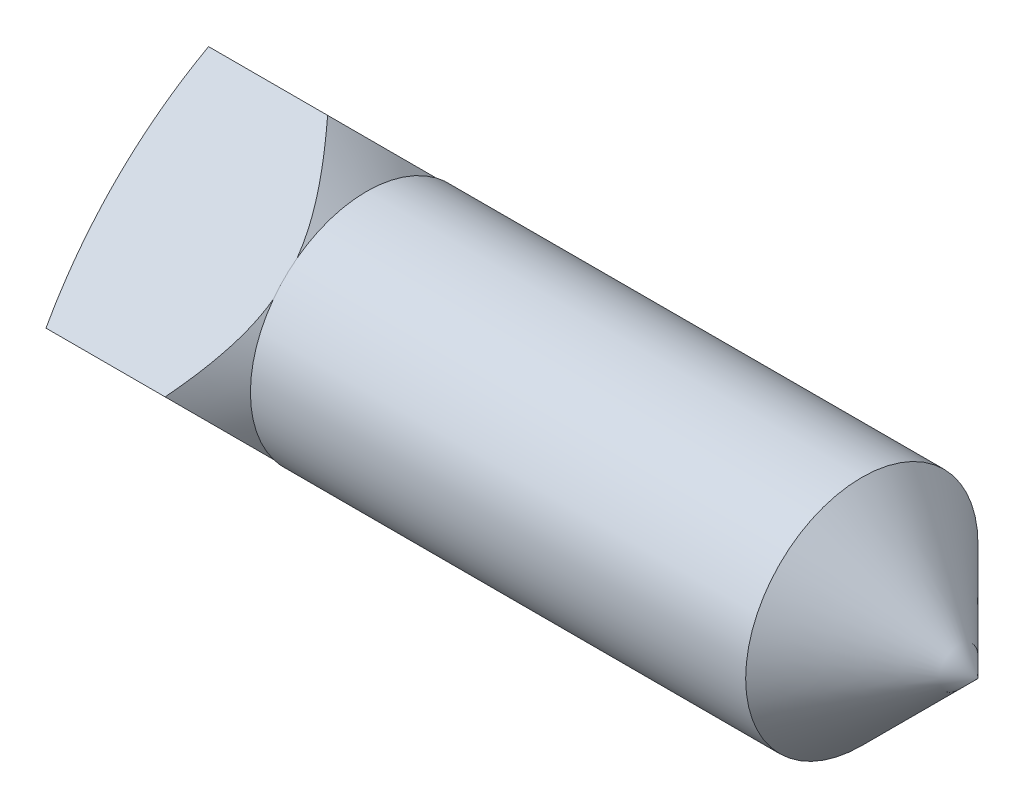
ISO-10303-21;
HEADER;
FILE_DESCRIPTION(('STEP AP214'),'2;1');
FILE_NAME('part.step','',(''),(''),'','','');
FILE_SCHEMA(('AUTOMOTIVE_DESIGN { 1 0 10303 214 1 1 1 1 }'));
ENDSEC;
DATA;
#1=APPLICATION_CONTEXT('core data for automotive mechanical design processes');
#2=APPLICATION_PROTOCOL_DEFINITION('international standard','automotive_design',2000,#1);
#3=PRODUCT_CONTEXT('',#1,'mechanical');
#4=PRODUCT('Part','Part','',(#3));
#5=PRODUCT_RELATED_PRODUCT_CATEGORY('part','',(#4));
#6=PRODUCT_DEFINITION_FORMATION('','',#4);
#7=PRODUCT_DEFINITION_CONTEXT('part definition',#1,'design');
#8=PRODUCT_DEFINITION('design','',#6,#7);
#9=PRODUCT_DEFINITION_SHAPE('','',#8);
#10=(LENGTH_UNIT() NAMED_UNIT(*) SI_UNIT(.MILLI.,.METRE.));
#11=(NAMED_UNIT(*) PLANE_ANGLE_UNIT() SI_UNIT($,.RADIAN.));
#12=(NAMED_UNIT(*) SI_UNIT($,.STERADIAN.) SOLID_ANGLE_UNIT());
#13=UNCERTAINTY_MEASURE_WITH_UNIT(LENGTH_MEASURE(1.E-05),#10,'distance_accuracy_value','');
#14=(GEOMETRIC_REPRESENTATION_CONTEXT(3) GLOBAL_UNCERTAINTY_ASSIGNED_CONTEXT((#13)) GLOBAL_UNIT_ASSIGNED_CONTEXT((#10,
#11,#12)) REPRESENTATION_CONTEXT('',''));
#15=CARTESIAN_POINT('',(0.,0.,0.));
#16=DIRECTION('',(0.,0.,1.));
#17=DIRECTION('',(1.,0.,0.));
#18=AXIS2_PLACEMENT_3D('',#15,#16,#17);
#19=CARTESIAN_POINT('',(-3.7592,0.,-3.376576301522));
#20=DIRECTION('',(0.,-0.707106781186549,0.707106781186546));
#21=DIRECTION('',(0.,-0.707106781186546,-0.707106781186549));
#22=AXIS2_PLACEMENT_3D('',#19,#20,#21);
#23=PLANE('',#22);
#24=CARTESIAN_POINT('',(-3.71463670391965,-2.84404188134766,-6.22061818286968));
#25=CARTESIAN_POINT('',(-3.55613835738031,-2.70146848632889,-6.07804478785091));
#26=CARTESIAN_POINT('',(-3.3981461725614,-2.55860959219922,-5.93518589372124));
#27=CARTESIAN_POINT('',(-3.08363247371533,-2.27203984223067,-5.64861614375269));
#28=CARTESIAN_POINT('',(-2.92711125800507,-2.12832882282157,-5.50490512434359));
#29=CARTESIAN_POINT('',(-2.61537743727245,-1.83919610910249,-5.2157724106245));
#30=CARTESIAN_POINT('',(-2.46017361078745,-1.69376967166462,-5.07034597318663));
#31=CARTESIAN_POINT('',(-2.15261018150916,-1.40143979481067,-4.77801609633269));
#32=CARTESIAN_POINT('',(-2.00025026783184,-1.25453651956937,-4.63111282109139));
#33=CARTESIAN_POINT('',(-1.72970912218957,-0.988182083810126,-4.36475838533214));
#34=CARTESIAN_POINT('',(-1.6107818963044,-0.869111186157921,-4.24568748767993));
#35=CARTESIAN_POINT('',(-1.37665028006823,-0.629105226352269,-4.00568152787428));
#36=CARTESIAN_POINT('',(-1.2614467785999,-0.508169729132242,-3.88474603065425));
#37=CARTESIAN_POINT('',(-1.03648369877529,-0.263755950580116,-3.64033225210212));
#38=CARTESIAN_POINT('',(-0.926724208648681,-0.140277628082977,-3.51685392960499));
#39=CARTESIAN_POINT('',(-0.768411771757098,0.0475823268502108,-3.3289939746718));
#40=CARTESIAN_POINT('',(-0.716703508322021,0.110632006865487,-3.26594429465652));
#41=CARTESIAN_POINT('',(-0.615958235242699,0.237786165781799,-3.13879013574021));
#42=CARTESIAN_POINT('',(-0.566920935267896,0.301890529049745,-3.07468577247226));
#43=CARTESIAN_POINT('',(-0.470564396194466,0.433616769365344,-2.94295953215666));
#44=CARTESIAN_POINT('',(-0.423365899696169,0.501283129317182,-2.87529317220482));
#45=CARTESIAN_POINT('',(-0.33366468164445,0.638144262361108,-2.7384320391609));
#46=CARTESIAN_POINT('',(-0.29116048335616,0.707338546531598,-2.66923775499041));
#47=CARTESIAN_POINT('',(-0.21229503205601,0.847303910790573,-2.52927239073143));
#48=CARTESIAN_POINT('',(-0.175920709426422,0.918071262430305,-2.4585050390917));
#49=CARTESIAN_POINT('',(-0.110910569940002,1.06137320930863,-2.31520309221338));
#50=CARTESIAN_POINT('',(-0.0822720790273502,1.13390718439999,-2.24266911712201));
#51=CARTESIAN_POINT('',(-0.0393755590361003,1.26582470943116,-2.11075159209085));
#52=CARTESIAN_POINT('',(-0.0233846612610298,1.3249242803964,-2.05165202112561));
#53=CARTESIAN_POINT('',(0.00161538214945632,1.44386018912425,-1.93271611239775));
#54=CARTESIAN_POINT('',(0.0106258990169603,1.50369637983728,-1.87287992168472));
#55=CARTESIAN_POINT('',(0.021092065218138,1.62355655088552,-1.75301975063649));
#56=CARTESIAN_POINT('',(0.0225662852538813,1.68357970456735,-1.69299659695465));
#57=CARTESIAN_POINT('',(0.0179155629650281,1.80348109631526,-1.57309520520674));
#58=CARTESIAN_POINT('',(0.0117896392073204,1.8633593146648,-1.5132169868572));
#59=CARTESIAN_POINT('',(-0.0100815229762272,1.99721927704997,-1.37935702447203));
#60=CARTESIAN_POINT('',(-0.02782647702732,2.0710373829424,-1.3055389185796));
#61=CARTESIAN_POINT('',(-0.0730208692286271,2.21718932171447,-1.15938697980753));
#62=CARTESIAN_POINT('',(-0.100477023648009,2.28952209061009,-1.08705421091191));
#63=CARTESIAN_POINT('',(-0.147658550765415,2.39694211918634,-0.979634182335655));
#64=CARTESIAN_POINT('',(-0.164455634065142,2.43269379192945,-0.943882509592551));
#65=CARTESIAN_POINT('',(-0.199813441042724,2.50374093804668,-0.872835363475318));
#66=CARTESIAN_POINT('',(-0.218373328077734,2.5390366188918,-0.837539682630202));
#67=CARTESIAN_POINT('',(-0.257053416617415,2.60919264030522,-0.767383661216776));
#68=CARTESIAN_POINT('',(-0.277173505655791,2.64405301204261,-0.732523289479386));
#69=CARTESIAN_POINT('',(-0.318791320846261,2.71336326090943,-0.663213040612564));
#70=CARTESIAN_POINT('',(-0.340289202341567,2.74781309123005,-0.628763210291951));
#71=CARTESIAN_POINT('',(-0.40321540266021,2.84534321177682,-0.531233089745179));
#72=CARTESIAN_POINT('',(-0.446099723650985,2.90795472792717,-0.468621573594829));
#73=CARTESIAN_POINT('',(-0.535121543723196,3.03201522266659,-0.344561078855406));
#74=CARTESIAN_POINT('',(-0.58125974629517,3.09346394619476,-0.28311235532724));
#75=CARTESIAN_POINT('',(-0.723571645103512,3.27639274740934,-0.100183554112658));
#76=CARTESIAN_POINT('',(-0.82358874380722,3.39637526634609,0.019798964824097));
#77=CARTESIAN_POINT('',(-1.03047356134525,3.63375592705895,0.257179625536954));
#78=CARTESIAN_POINT('',(-1.13735948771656,3.75114599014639,0.374569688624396));
#79=CARTESIAN_POINT('',(-1.35557896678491,3.98376603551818,0.607189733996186));
#80=CARTESIAN_POINT('',(-1.46691077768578,4.09899683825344,0.722420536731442));
#81=CARTESIAN_POINT('',(-1.69305612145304,4.32823502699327,0.951658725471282));
#82=CARTESIAN_POINT('',(-1.80787896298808,4.44223779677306,1.06566149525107));
#83=CARTESIAN_POINT('',(-2.03983717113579,4.66907271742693,1.29249641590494));
#84=CARTESIAN_POINT('',(-2.15697273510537,4.78190476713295,1.40532846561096));
#85=CARTESIAN_POINT('',(-2.39279712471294,5.00650286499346,1.62992656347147));
#86=CARTESIAN_POINT('',(-2.51148349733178,5.11827020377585,1.74169390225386));
#87=CARTESIAN_POINT('',(-2.75017246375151,5.34109999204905,1.96452369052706));
#88=CARTESIAN_POINT('',(-2.87017506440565,5.4521624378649,2.07558613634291));
#89=CARTESIAN_POINT('',(-3.05068333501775,5.61808795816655,2.24151165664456));
#90=CARTESIAN_POINT('',(-3.11080136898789,5.67316227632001,2.29658597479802));
#91=CARTESIAN_POINT('',(-3.23127854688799,5.78319708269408,2.40662078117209));
#92=CARTESIAN_POINT('',(-3.2916377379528,5.83815754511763,2.46158124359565));
#93=CARTESIAN_POINT('',(-3.41233885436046,5.94776482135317,2.57118851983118));
#94=CARTESIAN_POINT('',(-3.47268003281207,6.00241204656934,2.62583574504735));
#95=CARTESIAN_POINT('',(-3.59353260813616,6.11159399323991,2.73501769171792));
#96=CARTESIAN_POINT('',(-3.65404396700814,6.1661287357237,2.78955243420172));
#97=CARTESIAN_POINT('',(-3.71463670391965,6.22061818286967,2.84404188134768));
#98=B_SPLINE_CURVE_WITH_KNOTS('',3,(#24,#25,#26,#27,#28,#29,#30,#31,#32,#33,#34,#35,#36,#37,#38,
#39,#40,#41,#42,#43,#44,#45,#46,#47,#48,#49,#50,#51,#52,#53,#54,#55,#56,#57,#58,#59,#60,#61,#62,
#63,#64,#65,#66,#67,#68,#69,#70,#71,#72,#73,#74,#75,#76,#77,#78,#79,#80,#81,#82,#83,#84,#85,#86,
#87,#88,#89,#90,#91,#92,#93,#94,#95,#96,#97),.UNSPECIFIED.,.F.,.F.,(4,2,2,2,2,2,2,2,2,2,2,2,2,2,
2,2,2,2,2,2,2,2,2,2,2,2,2,2,2,2,2,2,2,2,2,2,4),(0.,0.769411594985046,1.53897600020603,
2.31192373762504,3.08478647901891,3.70321119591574,4.32178246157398,4.94036374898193,
5.24955145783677,5.55870549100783,5.87871228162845,6.19861811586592,6.51783299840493,
6.8369373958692,7.09196626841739,7.3469450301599,7.60129517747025,7.85567817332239,
8.17279662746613,8.49013483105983,8.6499415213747,8.80967274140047,8.96939245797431,
9.12913021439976,9.42418817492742,9.7193101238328,10.3099299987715,10.9021857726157,
11.4942117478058,12.0879855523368,12.6818102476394,13.2747881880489,13.8677692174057,
14.1629380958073,14.4581678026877,14.7523159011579,15.0464028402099),.UNSPECIFIED.);
#99=CARTESIAN_POINT('',(-0.808536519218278,0.,-3.376576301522));
#100=VERTEX_POINT('',#99);
#101=CARTESIAN_POINT('',(0.,1.44137193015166,-1.93520437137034));
#102=VERTEX_POINT('',#101);
#103=EDGE_CURVE('E157',#100,#102,#98,.T.);
#104=ORIENTED_EDGE('',*,*,#103,.F.);
#105=DIRECTION('',(1.,0.,0.));
#106=VECTOR('',#105,1.);
#107=CARTESIAN_POINT('',(-3.7592,0.,-3.376576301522));
#108=LINE('',#107,#106);
#109=CARTESIAN_POINT('',(-3.2823012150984,0.,-3.376576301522));
#110=VERTEX_POINT('',#109);
#111=EDGE_CURVE('E138',#110,#100,#108,.T.);
#112=ORIENTED_EDGE('',*,*,#111,.F.);
#113=CARTESIAN_POINT('',(8.4328,1.688288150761,-1.688288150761));
#114=DIRECTION('',(0.,-0.707106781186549,0.707106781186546));
#115=DIRECTION('',(0.,-0.707106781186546,-0.707106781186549));
#116=AXIS2_PLACEMENT_3D('',#113,#114,#115);
#117=CIRCLE('',#116,11.9559286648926);
#118=CARTESIAN_POINT('',(-3.2823012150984,3.376576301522,0.));
#119=VERTEX_POINT('',#118);
#120=EDGE_CURVE('E147',#119,#110,#117,.T.);
#121=ORIENTED_EDGE('',*,*,#120,.F.);
#122=DIRECTION('',(1.,0.,0.));
#123=VECTOR('',#122,1.);
#124=CARTESIAN_POINT('',(-3.7592,3.376576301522,0.));
#125=LINE('',#124,#123);
#126=CARTESIAN_POINT('',(-0.808536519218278,3.376576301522,0.));
#127=VERTEX_POINT('',#126);
#128=EDGE_CURVE('E145',#119,#127,#125,.T.);
#129=ORIENTED_EDGE('',*,*,#128,.T.);
#130=CARTESIAN_POINT('',(0.,1.93520437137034,-1.44137193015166));
#131=VERTEX_POINT('',#130);
#132=EDGE_CURVE('E167',#131,#127,#98,.T.);
#133=ORIENTED_EDGE('',*,*,#132,.F.);
#134=DIRECTION('',(0.,-0.707106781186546,-0.707106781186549));
#135=VECTOR('',#134,1.);
#136=CARTESIAN_POINT('',(0.,0.,-3.376576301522));
#137=LINE('',#136,#135);
#138=EDGE_CURVE('E41',#131,#102,#137,.T.);
#139=ORIENTED_EDGE('',*,*,#138,.T.);
#140=EDGE_LOOP('',(#104,#112,#121,#129,#133,#139));
#141=FACE_BOUND('',#140,.T.);
#142=ADVANCED_FACE('F33',(#141),#23,.F.);
#143=CARTESIAN_POINT('',(-3.7592,0.,-3.376576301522));
#144=DIRECTION('',(0.,0.707106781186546,0.707106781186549));
#145=DIRECTION('',(0.,-0.707106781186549,0.707106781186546));
#146=AXIS2_PLACEMENT_3D('',#143,#144,#145);
#147=PLANE('',#146);
#148=CARTESIAN_POINT('',(-3.71463670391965,-6.22061818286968,2.84404188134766));
#149=CARTESIAN_POINT('',(-3.55613835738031,-6.07804478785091,2.70146848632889));
#150=CARTESIAN_POINT('',(-3.3981461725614,-5.93518589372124,2.55860959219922));
#151=CARTESIAN_POINT('',(-3.08363247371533,-5.64861614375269,2.27203984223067));
#152=CARTESIAN_POINT('',(-2.92711125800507,-5.50490512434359,2.12832882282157));
#153=CARTESIAN_POINT('',(-2.61537743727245,-5.2157724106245,1.83919610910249));
#154=CARTESIAN_POINT('',(-2.46017361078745,-5.07034597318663,1.69376967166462));
#155=CARTESIAN_POINT('',(-2.15261018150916,-4.77801609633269,1.40143979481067));
#156=CARTESIAN_POINT('',(-2.00025026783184,-4.63111282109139,1.25453651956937));
#157=CARTESIAN_POINT('',(-1.72970912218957,-4.36475838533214,0.988182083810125));
#158=CARTESIAN_POINT('',(-1.6107818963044,-4.24568748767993,0.86911118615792));
#159=CARTESIAN_POINT('',(-1.37665028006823,-4.00568152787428,0.629105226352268));
#160=CARTESIAN_POINT('',(-1.2614467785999,-3.88474603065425,0.508169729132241));
#161=CARTESIAN_POINT('',(-1.03648369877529,-3.64033225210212,0.263755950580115));
#162=CARTESIAN_POINT('',(-0.92672420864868,-3.51685392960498,0.140277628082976));
#163=CARTESIAN_POINT('',(-0.768411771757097,-3.3289939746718,-0.0475823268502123));
#164=CARTESIAN_POINT('',(-0.716703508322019,-3.26594429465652,-0.110632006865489));
#165=CARTESIAN_POINT('',(-0.615958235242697,-3.13879013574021,-0.237786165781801));
#166=CARTESIAN_POINT('',(-0.566920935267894,-3.07468577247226,-0.301890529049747));
#167=CARTESIAN_POINT('',(-0.470564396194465,-2.94295953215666,-0.433616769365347));
#168=CARTESIAN_POINT('',(-0.423365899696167,-2.87529317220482,-0.501283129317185));
#169=CARTESIAN_POINT('',(-0.333664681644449,-2.7384320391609,-0.63814426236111));
#170=CARTESIAN_POINT('',(-0.291160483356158,-2.6692377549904,-0.707338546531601));
#171=CARTESIAN_POINT('',(-0.212295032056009,-2.52927239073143,-0.847303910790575));
#172=CARTESIAN_POINT('',(-0.175920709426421,-2.4585050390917,-0.918071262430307));
#173=CARTESIAN_POINT('',(-0.110910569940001,-2.31520309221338,-1.06137320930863));
#174=CARTESIAN_POINT('',(-0.08227207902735,-2.24266911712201,-1.13390718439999));
#175=CARTESIAN_POINT('',(-0.0393755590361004,-2.11075159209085,-1.26582470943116));
#176=CARTESIAN_POINT('',(-0.0233846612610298,-2.0516520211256,-1.3249242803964));
#177=CARTESIAN_POINT('',(0.00161538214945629,-1.93271611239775,-1.44386018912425));
#178=CARTESIAN_POINT('',(0.0106258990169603,-1.87287992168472,-1.50369637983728));
#179=CARTESIAN_POINT('',(0.0210920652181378,-1.75301975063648,-1.62355655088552));
#180=CARTESIAN_POINT('',(0.0225662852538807,-1.69299659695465,-1.68357970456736));
#181=CARTESIAN_POINT('',(0.0179155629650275,-1.57309520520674,-1.80348109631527));
#182=CARTESIAN_POINT('',(0.01178963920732,-1.5132169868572,-1.8633593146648));
#183=CARTESIAN_POINT('',(-0.0100815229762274,-1.37935702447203,-1.99721927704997));
#184=CARTESIAN_POINT('',(-0.0278264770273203,-1.3055389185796,-2.0710373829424));
#185=CARTESIAN_POINT('',(-0.0730208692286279,-1.15938697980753,-2.21718932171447));
#186=CARTESIAN_POINT('',(-0.10047702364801,-1.08705421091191,-2.28952209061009));
#187=CARTESIAN_POINT('',(-0.147658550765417,-0.979634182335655,-2.39694211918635));
#188=CARTESIAN_POINT('',(-0.164455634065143,-0.94388250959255,-2.43269379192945));
#189=CARTESIAN_POINT('',(-0.199813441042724,-0.872835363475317,-2.50374093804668));
#190=CARTESIAN_POINT('',(-0.218373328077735,-0.837539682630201,-2.5390366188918));
#191=CARTESIAN_POINT('',(-0.257053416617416,-0.767383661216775,-2.60919264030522));
#192=CARTESIAN_POINT('',(-0.277173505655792,-0.732523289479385,-2.64405301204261));
#193=CARTESIAN_POINT('',(-0.318791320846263,-0.663213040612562,-2.71336326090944));
#194=CARTESIAN_POINT('',(-0.340289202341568,-0.628763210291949,-2.74781309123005));
#195=CARTESIAN_POINT('',(-0.403215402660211,-0.531233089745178,-2.84534321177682));
#196=CARTESIAN_POINT('',(-0.446099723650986,-0.468621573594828,-2.90795472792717));
#197=CARTESIAN_POINT('',(-0.535121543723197,-0.344561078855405,-3.03201522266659));
#198=CARTESIAN_POINT('',(-0.581259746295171,-0.283112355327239,-3.09346394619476));
#199=CARTESIAN_POINT('',(-0.723571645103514,-0.100183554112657,-3.27639274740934));
#200=CARTESIAN_POINT('',(-0.823588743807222,0.0197989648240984,-3.39637526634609));
#201=CARTESIAN_POINT('',(-1.03047356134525,0.257179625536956,-3.63375592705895));
#202=CARTESIAN_POINT('',(-1.13735948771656,0.374569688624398,-3.75114599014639));
#203=CARTESIAN_POINT('',(-1.35557896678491,0.607189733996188,-3.98376603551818));
#204=CARTESIAN_POINT('',(-1.46691077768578,0.722420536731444,-4.09899683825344));
#205=CARTESIAN_POINT('',(-1.69305612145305,0.951658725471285,-4.32823502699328));
#206=CARTESIAN_POINT('',(-1.80787896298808,1.06566149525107,-4.44223779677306));
#207=CARTESIAN_POINT('',(-2.03983717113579,1.29249641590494,-4.66907271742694));
#208=CARTESIAN_POINT('',(-2.15697273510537,1.40532846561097,-4.78190476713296));
#209=CARTESIAN_POINT('',(-2.39279712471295,1.62992656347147,-5.00650286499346));
#210=CARTESIAN_POINT('',(-2.51148349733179,1.74169390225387,-5.11827020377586));
#211=CARTESIAN_POINT('',(-2.75017246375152,1.96452369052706,-5.34109999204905));
#212=CARTESIAN_POINT('',(-2.87017506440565,2.07558613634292,-5.4521624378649));
#213=CARTESIAN_POINT('',(-3.05068333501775,2.24151165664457,-5.61808795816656));
#214=CARTESIAN_POINT('',(-3.11080136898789,2.29658597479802,-5.67316227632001));
#215=CARTESIAN_POINT('',(-3.231278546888,2.40662078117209,-5.78319708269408));
#216=CARTESIAN_POINT('',(-3.29163773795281,2.46158124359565,-5.83815754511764));
#217=CARTESIAN_POINT('',(-3.41233885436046,2.57118851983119,-5.94776482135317));
#218=CARTESIAN_POINT('',(-3.47268003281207,2.62583574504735,-6.00241204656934));
#219=CARTESIAN_POINT('',(-3.59353260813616,2.73501769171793,-6.11159399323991));
#220=CARTESIAN_POINT('',(-3.65404396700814,2.78955243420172,-6.1661287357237));
#221=CARTESIAN_POINT('',(-3.71463670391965,2.84404188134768,-6.22061818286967));
#222=B_SPLINE_CURVE_WITH_KNOTS('',3,(#148,#149,#150,#151,#152,#153,#154,#155,#156,#157,#158,
#159,#160,#161,#162,#163,#164,#165,#166,#167,#168,#169,#170,#171,#172,#173,#174,#175,#176,#177,
#178,#179,#180,#181,#182,#183,#184,#185,#186,#187,#188,#189,#190,#191,#192,#193,#194,#195,#196,
#197,#198,#199,#200,#201,#202,#203,#204,#205,#206,#207,#208,#209,#210,#211,#212,#213,#214,#215,
#216,#217,#218,#219,#220,#221),.UNSPECIFIED.,.F.,.F.,(4,2,2,2,2,2,2,2,2,2,2,2,2,2,2,2,2,2,2,2,2,
2,2,2,2,2,2,2,2,2,2,2,2,2,2,2,4),(0.,0.769411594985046,1.53897600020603,2.31192373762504,
3.0847864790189,3.70321119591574,4.32178246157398,4.94036374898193,5.24955145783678,
5.55870549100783,5.87871228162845,6.19861811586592,6.51783299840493,6.8369373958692,
7.09196626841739,7.3469450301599,7.60129517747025,7.85567817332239,8.17279662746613,
8.49013483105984,8.6499415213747,8.80967274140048,8.96939245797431,9.12913021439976,
9.42418817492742,9.7193101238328,10.3099299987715,10.9021857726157,11.4942117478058,
12.0879855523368,12.6818102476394,13.2747881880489,13.8677692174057,14.1629380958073,
14.4581678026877,14.7523159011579,15.0464028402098),.UNSPECIFIED.);
#223=CARTESIAN_POINT('',(-0.808536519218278,-3.376576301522,0.));
#224=VERTEX_POINT('',#223);
#225=CARTESIAN_POINT('',(0.,-1.93520437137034,-1.44137193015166));
#226=VERTEX_POINT('',#225);
#227=EDGE_CURVE('E158',#224,#226,#222,.T.);
#228=ORIENTED_EDGE('',*,*,#227,.F.);
#229=DIRECTION('',(1.,0.,0.));
#230=VECTOR('',#229,1.);
#231=CARTESIAN_POINT('',(-3.7592,-3.376576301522,0.));
#232=LINE('',#231,#230);
#233=CARTESIAN_POINT('',(-3.2823012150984,-3.376576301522,0.));
#234=VERTEX_POINT('',#233);
#235=EDGE_CURVE('E141',#234,#224,#232,.T.);
#236=ORIENTED_EDGE('',*,*,#235,.F.);
#237=CARTESIAN_POINT('',(8.4328,-1.688288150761,-1.688288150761));
#238=DIRECTION('',(0.,0.707106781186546,0.707106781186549));
#239=DIRECTION('',(0.,-0.707106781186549,0.707106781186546));
#240=AXIS2_PLACEMENT_3D('',#237,#238,#239);
#241=CIRCLE('',#240,11.9559286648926);
#242=EDGE_CURVE('E154',#110,#234,#241,.T.);
#243=ORIENTED_EDGE('',*,*,#242,.F.);
#244=ORIENTED_EDGE('',*,*,#111,.T.);
#245=CARTESIAN_POINT('',(0.,-1.44137193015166,-1.93520437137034));
#246=VERTEX_POINT('',#245);
#247=EDGE_CURVE('E165',#246,#100,#222,.T.);
#248=ORIENTED_EDGE('',*,*,#247,.F.);
#249=DIRECTION('',(0.,-0.707106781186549,0.707106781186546));
#250=VECTOR('',#249,1.);
#251=CARTESIAN_POINT('',(0.,0.,-3.376576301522));
#252=LINE('',#251,#250);
#253=EDGE_CURVE('E131',#246,#226,#252,.T.);
#254=ORIENTED_EDGE('',*,*,#253,.T.);
#255=EDGE_LOOP('',(#228,#236,#243,#244,#248,#254));
#256=FACE_BOUND('',#255,.T.);
#257=ADVANCED_FACE('F173',(#256),#147,.F.);
#258=CARTESIAN_POINT('',(-3.7592,-3.376576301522,0.));
#259=DIRECTION('',(0.,0.707106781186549,-0.707106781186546));
#260=DIRECTION('',(0.,0.707106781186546,0.707106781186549));
#261=AXIS2_PLACEMENT_3D('',#258,#259,#260);
#262=PLANE('',#261);
#263=CARTESIAN_POINT('',(-3.71463670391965,2.84404188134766,6.22061818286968));
#264=CARTESIAN_POINT('',(-3.55613835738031,2.70146848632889,6.07804478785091));
#265=CARTESIAN_POINT('',(-3.3981461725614,2.55860959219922,5.93518589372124));
#266=CARTESIAN_POINT('',(-3.08363247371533,2.27203984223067,5.64861614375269));
#267=CARTESIAN_POINT('',(-2.92711125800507,2.12832882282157,5.50490512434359));
#268=CARTESIAN_POINT('',(-2.61537743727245,1.83919610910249,5.2157724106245));
#269=CARTESIAN_POINT('',(-2.46017361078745,1.69376967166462,5.07034597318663));
#270=CARTESIAN_POINT('',(-2.15261018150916,1.40143979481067,4.77801609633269));
#271=CARTESIAN_POINT('',(-2.00025026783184,1.25453651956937,4.63111282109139));
#272=CARTESIAN_POINT('',(-1.72970912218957,0.988182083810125,4.36475838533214));
#273=CARTESIAN_POINT('',(-1.6107818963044,0.86911118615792,4.24568748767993));
#274=CARTESIAN_POINT('',(-1.37665028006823,0.629105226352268,4.00568152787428));
#275=CARTESIAN_POINT('',(-1.2614467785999,0.508169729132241,3.88474603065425));
#276=CARTESIAN_POINT('',(-1.03648369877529,0.263755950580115,3.64033225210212));
#277=CARTESIAN_POINT('',(-0.92672420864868,0.140277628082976,3.51685392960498));
#278=CARTESIAN_POINT('',(-0.768411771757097,-0.0475823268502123,3.3289939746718));
#279=CARTESIAN_POINT('',(-0.716703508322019,-0.110632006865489,3.26594429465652));
#280=CARTESIAN_POINT('',(-0.615958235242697,-0.237786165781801,3.13879013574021));
#281=CARTESIAN_POINT('',(-0.566920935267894,-0.301890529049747,3.07468577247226));
#282=CARTESIAN_POINT('',(-0.470564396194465,-0.433616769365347,2.94295953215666));
#283=CARTESIAN_POINT('',(-0.423365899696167,-0.501283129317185,2.87529317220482));
#284=CARTESIAN_POINT('',(-0.333664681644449,-0.63814426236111,2.7384320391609));
#285=CARTESIAN_POINT('',(-0.291160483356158,-0.707338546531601,2.6692377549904));
#286=CARTESIAN_POINT('',(-0.212295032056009,-0.847303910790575,2.52927239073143));
#287=CARTESIAN_POINT('',(-0.175920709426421,-0.918071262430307,2.4585050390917));
#288=CARTESIAN_POINT('',(-0.110910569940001,-1.06137320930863,2.31520309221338));
#289=CARTESIAN_POINT('',(-0.08227207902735,-1.13390718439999,2.24266911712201));
#290=CARTESIAN_POINT('',(-0.0393755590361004,-1.26582470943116,2.11075159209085));
#291=CARTESIAN_POINT('',(-0.0233846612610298,-1.3249242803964,2.0516520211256));
#292=CARTESIAN_POINT('',(0.00161538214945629,-1.44386018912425,1.93271611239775));
#293=CARTESIAN_POINT('',(0.0106258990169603,-1.50369637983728,1.87287992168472));
#294=CARTESIAN_POINT('',(0.0210920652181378,-1.62355655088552,1.75301975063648));
#295=CARTESIAN_POINT('',(0.0225662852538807,-1.68357970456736,1.69299659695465));
#296=CARTESIAN_POINT('',(0.0179155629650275,-1.80348109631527,1.57309520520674));
#297=CARTESIAN_POINT('',(0.01178963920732,-1.8633593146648,1.5132169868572));
#298=CARTESIAN_POINT('',(-0.0100815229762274,-1.99721927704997,1.37935702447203));
#299=CARTESIAN_POINT('',(-0.0278264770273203,-2.0710373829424,1.3055389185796));
#300=CARTESIAN_POINT('',(-0.0730208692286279,-2.21718932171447,1.15938697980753));
#301=CARTESIAN_POINT('',(-0.10047702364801,-2.28952209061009,1.08705421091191));
#302=CARTESIAN_POINT('',(-0.147658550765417,-2.39694211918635,0.979634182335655));
#303=CARTESIAN_POINT('',(-0.164455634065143,-2.43269379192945,0.94388250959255));
#304=CARTESIAN_POINT('',(-0.199813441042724,-2.50374093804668,0.872835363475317));
#305=CARTESIAN_POINT('',(-0.218373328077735,-2.5390366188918,0.837539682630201));
#306=CARTESIAN_POINT('',(-0.257053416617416,-2.60919264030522,0.767383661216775));
#307=CARTESIAN_POINT('',(-0.277173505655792,-2.64405301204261,0.732523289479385));
#308=CARTESIAN_POINT('',(-0.318791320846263,-2.71336326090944,0.663213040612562));
#309=CARTESIAN_POINT('',(-0.340289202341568,-2.74781309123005,0.628763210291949));
#310=CARTESIAN_POINT('',(-0.403215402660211,-2.84534321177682,0.531233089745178));
#311=CARTESIAN_POINT('',(-0.446099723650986,-2.90795472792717,0.468621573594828));
#312=CARTESIAN_POINT('',(-0.535121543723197,-3.03201522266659,0.344561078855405));
#313=CARTESIAN_POINT('',(-0.581259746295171,-3.09346394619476,0.283112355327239));
#314=CARTESIAN_POINT('',(-0.723571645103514,-3.27639274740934,0.100183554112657));
#315=CARTESIAN_POINT('',(-0.823588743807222,-3.39637526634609,-0.0197989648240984));
#316=CARTESIAN_POINT('',(-1.03047356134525,-3.63375592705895,-0.257179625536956));
#317=CARTESIAN_POINT('',(-1.13735948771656,-3.75114599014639,-0.374569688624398));
#318=CARTESIAN_POINT('',(-1.35557896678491,-3.98376603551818,-0.607189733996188));
#319=CARTESIAN_POINT('',(-1.46691077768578,-4.09899683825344,-0.722420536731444));
#320=CARTESIAN_POINT('',(-1.69305612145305,-4.32823502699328,-0.951658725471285));
#321=CARTESIAN_POINT('',(-1.80787896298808,-4.44223779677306,-1.06566149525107));
#322=CARTESIAN_POINT('',(-2.03983717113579,-4.66907271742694,-1.29249641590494));
#323=CARTESIAN_POINT('',(-2.15697273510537,-4.78190476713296,-1.40532846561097));
#324=CARTESIAN_POINT('',(-2.39279712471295,-5.00650286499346,-1.62992656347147));
#325=CARTESIAN_POINT('',(-2.51148349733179,-5.11827020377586,-1.74169390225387));
#326=CARTESIAN_POINT('',(-2.75017246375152,-5.34109999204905,-1.96452369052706));
#327=CARTESIAN_POINT('',(-2.87017506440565,-5.4521624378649,-2.07558613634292));
#328=CARTESIAN_POINT('',(-3.05068333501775,-5.61808795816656,-2.24151165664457));
#329=CARTESIAN_POINT('',(-3.11080136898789,-5.67316227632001,-2.29658597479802));
#330=CARTESIAN_POINT('',(-3.231278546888,-5.78319708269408,-2.40662078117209));
#331=CARTESIAN_POINT('',(-3.29163773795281,-5.83815754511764,-2.46158124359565));
#332=CARTESIAN_POINT('',(-3.41233885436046,-5.94776482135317,-2.57118851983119));
#333=CARTESIAN_POINT('',(-3.47268003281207,-6.00241204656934,-2.62583574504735));
#334=CARTESIAN_POINT('',(-3.59353260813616,-6.11159399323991,-2.73501769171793));
#335=CARTESIAN_POINT('',(-3.65404396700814,-6.1661287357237,-2.78955243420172));
#336=CARTESIAN_POINT('',(-3.71463670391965,-6.22061818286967,-2.84404188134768));
#337=B_SPLINE_CURVE_WITH_KNOTS('',3,(#263,#264,#265,#266,#267,#268,#269,#270,#271,#272,#273,
#274,#275,#276,#277,#278,#279,#280,#281,#282,#283,#284,#285,#286,#287,#288,#289,#290,#291,#292,
#293,#294,#295,#296,#297,#298,#299,#300,#301,#302,#303,#304,#305,#306,#307,#308,#309,#310,#311,
#312,#313,#314,#315,#316,#317,#318,#319,#320,#321,#322,#323,#324,#325,#326,#327,#328,#329,#330,
#331,#332,#333,#334,#335,#336),.UNSPECIFIED.,.F.,.F.,(4,2,2,2,2,2,2,2,2,2,2,2,2,2,2,2,2,2,2,2,2,
2,2,2,2,2,2,2,2,2,2,2,2,2,2,2,4),(0.,0.769411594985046,1.53897600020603,2.31192373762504,
3.0847864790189,3.70321119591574,4.32178246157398,4.94036374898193,5.24955145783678,
5.55870549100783,5.87871228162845,6.19861811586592,6.51783299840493,6.8369373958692,
7.09196626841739,7.3469450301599,7.60129517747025,7.85567817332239,8.17279662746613,
8.49013483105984,8.6499415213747,8.80967274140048,8.96939245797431,9.12913021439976,
9.42418817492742,9.7193101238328,10.3099299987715,10.9021857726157,11.4942117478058,
12.0879855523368,12.6818102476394,13.2747881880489,13.8677692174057,14.1629380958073,
14.4581678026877,14.7523159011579,15.0464028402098),.UNSPECIFIED.);
#338=CARTESIAN_POINT('',(-0.808536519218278,0.,3.376576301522));
#339=VERTEX_POINT('',#338);
#340=CARTESIAN_POINT('',(0.,-1.44137193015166,1.93520437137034));
#341=VERTEX_POINT('',#340);
#342=EDGE_CURVE('E55',#339,#341,#337,.T.);
#343=ORIENTED_EDGE('',*,*,#342,.F.);
#344=DIRECTION('',(1.,0.,0.));
#345=VECTOR('',#344,1.);
#346=CARTESIAN_POINT('',(-3.7592,0.,3.376576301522));
#347=LINE('',#346,#345);
#348=CARTESIAN_POINT('',(-3.2823012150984,0.,3.376576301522));
#349=VERTEX_POINT('',#348);
#350=EDGE_CURVE('E119',#349,#339,#347,.T.);
#351=ORIENTED_EDGE('',*,*,#350,.F.);
#352=CARTESIAN_POINT('',(8.4328,-1.688288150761,1.688288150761));
#353=DIRECTION('',(0.,0.707106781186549,-0.707106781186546));
#354=DIRECTION('',(0.,0.707106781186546,0.707106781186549));
#355=AXIS2_PLACEMENT_3D('',#352,#353,#354);
#356=CIRCLE('',#355,11.9559286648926);
#357=EDGE_CURVE('E47',#234,#349,#356,.T.);
#358=ORIENTED_EDGE('',*,*,#357,.F.);
#359=ORIENTED_EDGE('',*,*,#235,.T.);
#360=CARTESIAN_POINT('',(0.,-1.93520437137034,1.44137193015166));
#361=VERTEX_POINT('',#360);
#362=EDGE_CURVE('E166',#361,#224,#337,.T.);
#363=ORIENTED_EDGE('',*,*,#362,.F.);
#364=DIRECTION('',(0.,0.707106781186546,0.707106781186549));
#365=VECTOR('',#364,1.);
#366=CARTESIAN_POINT('',(0.,-3.376576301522,0.));
#367=LINE('',#366,#365);
#368=EDGE_CURVE('E125',#361,#341,#367,.T.);
#369=ORIENTED_EDGE('',*,*,#368,.T.);
#370=EDGE_LOOP('',(#343,#351,#358,#359,#363,#369));
#371=FACE_BOUND('',#370,.T.);
#372=ADVANCED_FACE('F194',(#371),#262,.F.);
#373=CARTESIAN_POINT('',(-3.7592,3.376576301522,0.));
#374=DIRECTION('',(0.,-0.707106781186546,-0.707106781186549));
#375=DIRECTION('',(0.,0.707106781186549,-0.707106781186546));
#376=AXIS2_PLACEMENT_3D('',#373,#374,#375);
#377=PLANE('',#376);
#378=CARTESIAN_POINT('',(-3.71463670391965,6.22061818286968,-2.84404188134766));
#379=CARTESIAN_POINT('',(-3.55613835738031,6.07804478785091,-2.70146848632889));
#380=CARTESIAN_POINT('',(-3.3981461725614,5.93518589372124,-2.55860959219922));
#381=CARTESIAN_POINT('',(-3.08363247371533,5.64861614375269,-2.27203984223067));
#382=CARTESIAN_POINT('',(-2.92711125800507,5.50490512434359,-2.12832882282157));
#383=CARTESIAN_POINT('',(-2.61537743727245,5.2157724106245,-1.83919610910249));
#384=CARTESIAN_POINT('',(-2.46017361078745,5.07034597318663,-1.69376967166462));
#385=CARTESIAN_POINT('',(-2.15261018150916,4.77801609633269,-1.40143979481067));
#386=CARTESIAN_POINT('',(-2.00025026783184,4.63111282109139,-1.25453651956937));
#387=CARTESIAN_POINT('',(-1.72970912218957,4.36475838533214,-0.988182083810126));
#388=CARTESIAN_POINT('',(-1.6107818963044,4.24568748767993,-0.869111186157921));
#389=CARTESIAN_POINT('',(-1.37665028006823,4.00568152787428,-0.629105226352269));
#390=CARTESIAN_POINT('',(-1.2614467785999,3.88474603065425,-0.508169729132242));
#391=CARTESIAN_POINT('',(-1.03648369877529,3.64033225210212,-0.263755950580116));
#392=CARTESIAN_POINT('',(-0.926724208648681,3.51685392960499,-0.140277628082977));
#393=CARTESIAN_POINT('',(-0.768411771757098,3.3289939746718,0.0475823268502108));
#394=CARTESIAN_POINT('',(-0.716703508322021,3.26594429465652,0.110632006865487));
#395=CARTESIAN_POINT('',(-0.615958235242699,3.13879013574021,0.237786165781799));
#396=CARTESIAN_POINT('',(-0.566920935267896,3.07468577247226,0.301890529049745));
#397=CARTESIAN_POINT('',(-0.470564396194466,2.94295953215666,0.433616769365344));
#398=CARTESIAN_POINT('',(-0.423365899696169,2.87529317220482,0.501283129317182));
#399=CARTESIAN_POINT('',(-0.33366468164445,2.7384320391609,0.638144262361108));
#400=CARTESIAN_POINT('',(-0.29116048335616,2.66923775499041,0.707338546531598));
#401=CARTESIAN_POINT('',(-0.21229503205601,2.52927239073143,0.847303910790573));
#402=CARTESIAN_POINT('',(-0.175920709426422,2.4585050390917,0.918071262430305));
#403=CARTESIAN_POINT('',(-0.110910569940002,2.31520309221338,1.06137320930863));
#404=CARTESIAN_POINT('',(-0.0822720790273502,2.24266911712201,1.13390718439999));
#405=CARTESIAN_POINT('',(-0.0393755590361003,2.11075159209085,1.26582470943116));
#406=CARTESIAN_POINT('',(-0.0233846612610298,2.05165202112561,1.3249242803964));
#407=CARTESIAN_POINT('',(0.00161538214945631,1.93271611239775,1.44386018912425));
#408=CARTESIAN_POINT('',(0.0106258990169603,1.87287992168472,1.50369637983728));
#409=CARTESIAN_POINT('',(0.021092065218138,1.75301975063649,1.62355655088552));
#410=CARTESIAN_POINT('',(0.0225662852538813,1.69299659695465,1.68357970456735));
#411=CARTESIAN_POINT('',(0.0179155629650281,1.57309520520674,1.80348109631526));
#412=CARTESIAN_POINT('',(0.0117896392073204,1.5132169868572,1.8633593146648));
#413=CARTESIAN_POINT('',(-0.0100815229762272,1.37935702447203,1.99721927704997));
#414=CARTESIAN_POINT('',(-0.0278264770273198,1.3055389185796,2.0710373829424));
#415=CARTESIAN_POINT('',(-0.073020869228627,1.15938697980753,2.21718932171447));
#416=CARTESIAN_POINT('',(-0.100477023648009,1.08705421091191,2.28952209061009));
#417=CARTESIAN_POINT('',(-0.147658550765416,0.979634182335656,2.39694211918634));
#418=CARTESIAN_POINT('',(-0.164455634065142,0.943882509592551,2.43269379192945));
#419=CARTESIAN_POINT('',(-0.199813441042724,0.872835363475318,2.50374093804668));
#420=CARTESIAN_POINT('',(-0.218373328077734,0.837539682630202,2.5390366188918));
#421=CARTESIAN_POINT('',(-0.257053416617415,0.767383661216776,2.60919264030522));
#422=CARTESIAN_POINT('',(-0.277173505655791,0.732523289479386,2.64405301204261));
#423=CARTESIAN_POINT('',(-0.318791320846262,0.663213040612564,2.71336326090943));
#424=CARTESIAN_POINT('',(-0.340289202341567,0.628763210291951,2.74781309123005));
#425=CARTESIAN_POINT('',(-0.40321540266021,0.531233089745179,2.84534321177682));
#426=CARTESIAN_POINT('',(-0.446099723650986,0.468621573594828,2.90795472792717));
#427=CARTESIAN_POINT('',(-0.535121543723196,0.344561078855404,3.03201522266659));
#428=CARTESIAN_POINT('',(-0.58125974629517,0.283112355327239,3.09346394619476));
#429=CARTESIAN_POINT('',(-0.723571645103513,0.100183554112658,3.27639274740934));
#430=CARTESIAN_POINT('',(-0.823588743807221,-0.0197989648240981,3.39637526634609));
#431=CARTESIAN_POINT('',(-1.03047356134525,-0.257179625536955,3.63375592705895));
#432=CARTESIAN_POINT('',(-1.13735948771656,-0.374569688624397,3.75114599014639));
#433=CARTESIAN_POINT('',(-1.35557896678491,-0.607189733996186,3.98376603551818));
#434=CARTESIAN_POINT('',(-1.46691077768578,-0.722420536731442,4.09899683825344));
#435=CARTESIAN_POINT('',(-1.69305612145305,-0.951658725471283,4.32823502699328));
#436=CARTESIAN_POINT('',(-1.80787896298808,-1.06566149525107,4.44223779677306));
#437=CARTESIAN_POINT('',(-2.03983717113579,-1.29249641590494,4.66907271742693));
#438=CARTESIAN_POINT('',(-2.15697273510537,-1.40532846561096,4.78190476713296));
#439=CARTESIAN_POINT('',(-2.39279712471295,-1.62992656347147,5.00650286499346));
#440=CARTESIAN_POINT('',(-2.51148349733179,-1.74169390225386,5.11827020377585));
#441=CARTESIAN_POINT('',(-2.75017246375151,-1.96452369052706,5.34109999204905));
#442=CARTESIAN_POINT('',(-2.87017506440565,-2.07558613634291,5.4521624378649));
#443=CARTESIAN_POINT('',(-3.05068333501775,-2.24151165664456,5.61808795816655));
#444=CARTESIAN_POINT('',(-3.11080136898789,-2.29658597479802,5.67316227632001));
#445=CARTESIAN_POINT('',(-3.231278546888,-2.40662078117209,5.78319708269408));
#446=CARTESIAN_POINT('',(-3.29163773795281,-2.46158124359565,5.83815754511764));
#447=CARTESIAN_POINT('',(-3.41233885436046,-2.57118851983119,5.94776482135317));
#448=CARTESIAN_POINT('',(-3.47268003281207,-2.62583574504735,6.00241204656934));
#449=CARTESIAN_POINT('',(-3.59353260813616,-2.73501769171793,6.11159399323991));
#450=CARTESIAN_POINT('',(-3.65404396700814,-2.78955243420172,6.1661287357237));
#451=CARTESIAN_POINT('',(-3.71463670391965,-2.84404188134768,6.22061818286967));
#452=B_SPLINE_CURVE_WITH_KNOTS('',3,(#378,#379,#380,#381,#382,#383,#384,#385,#386,#387,#388,
#389,#390,#391,#392,#393,#394,#395,#396,#397,#398,#399,#400,#401,#402,#403,#404,#405,#406,#407,
#408,#409,#410,#411,#412,#413,#414,#415,#416,#417,#418,#419,#420,#421,#422,#423,#424,#425,#426,
#427,#428,#429,#430,#431,#432,#433,#434,#435,#436,#437,#438,#439,#440,#441,#442,#443,#444,#445,
#446,#447,#448,#449,#450,#451),.UNSPECIFIED.,.F.,.F.,(4,2,2,2,2,2,2,2,2,2,2,2,2,2,2,2,2,2,2,2,2,
2,2,2,2,2,2,2,2,2,2,2,2,2,2,2,4),(0.,0.769411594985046,1.53897600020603,2.31192373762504,
3.08478647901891,3.70321119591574,4.32178246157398,4.94036374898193,5.24955145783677,
5.55870549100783,5.87871228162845,6.19861811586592,6.51783299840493,6.8369373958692,
7.09196626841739,7.3469450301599,7.60129517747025,7.85567817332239,8.17279662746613,
8.49013483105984,8.6499415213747,8.80967274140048,8.96939245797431,9.12913021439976,
9.42418817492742,9.7193101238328,10.3099299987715,10.9021857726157,11.4942117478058,
12.0879855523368,12.6818102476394,13.2747881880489,13.8677692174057,14.1629380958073,
14.4581678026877,14.7523159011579,15.0464028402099),.UNSPECIFIED.);
#453=CARTESIAN_POINT('',(0.,1.93520437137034,1.44137193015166));
#454=VERTEX_POINT('',#453);
#455=EDGE_CURVE('E121',#127,#454,#452,.T.);
#456=ORIENTED_EDGE('',*,*,#455,.F.);
#457=ORIENTED_EDGE('',*,*,#128,.F.);
#458=CARTESIAN_POINT('',(8.4328,1.688288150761,1.688288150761));
#459=DIRECTION('',(0.,-0.707106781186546,-0.707106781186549));
#460=DIRECTION('',(0.,0.707106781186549,-0.707106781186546));
#461=AXIS2_PLACEMENT_3D('',#458,#459,#460);
#462=CIRCLE('',#461,11.9559286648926);
#463=EDGE_CURVE('E11',#349,#119,#462,.T.);
#464=ORIENTED_EDGE('',*,*,#463,.F.);
#465=ORIENTED_EDGE('',*,*,#350,.T.);
#466=CARTESIAN_POINT('',(0.,1.44137193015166,1.93520437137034));
#467=VERTEX_POINT('',#466);
#468=EDGE_CURVE('E103',#467,#339,#452,.T.);
#469=ORIENTED_EDGE('',*,*,#468,.F.);
#470=DIRECTION('',(0.,0.707106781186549,-0.707106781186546));
#471=VECTOR('',#470,1.);
#472=CARTESIAN_POINT('',(0.,3.376576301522,0.));
#473=LINE('',#472,#471);
#474=EDGE_CURVE('E117',#467,#454,#473,.T.);
#475=ORIENTED_EDGE('',*,*,#474,.T.);
#476=EDGE_LOOP('',(#456,#457,#464,#465,#469,#475));
#477=FACE_BOUND('',#476,.T.);
#478=ADVANCED_FACE('F116',(#477),#377,.F.);
#479=CARTESIAN_POINT('',(0.,0.,0.));
#480=DIRECTION('',(-1.,0.,0.));
#481=DIRECTION('',(0.,0.,1.));
#482=AXIS2_PLACEMENT_3D('',#479,#480,#481);
#483=PLANE('',#482);
#484=ORIENTED_EDGE('',*,*,#138,.F.);
#485=CARTESIAN_POINT('',(0.,0.,0.));
#486=DIRECTION('',(-1.,0.,0.));
#487=DIRECTION('',(0.,0.,1.));
#488=AXIS2_PLACEMENT_3D('',#485,#486,#487);
#489=CIRCLE('',#488,2.413);
#490=EDGE_CURVE('E134',#131,#102,#489,.T.);
#491=ORIENTED_EDGE('',*,*,#490,.T.);
#492=EDGE_LOOP('',(#484,#491));
#493=FACE_BOUND('',#492,.T.);
#494=ADVANCED_FACE('F200',(#493),#483,.T.);
#495=ORIENTED_EDGE('',*,*,#474,.F.);
#496=EDGE_CURVE('E110',#467,#454,#489,.T.);
#497=ORIENTED_EDGE('',*,*,#496,.T.);
#498=EDGE_LOOP('',(#495,#497));
#499=FACE_BOUND('',#498,.T.);
#500=ADVANCED_FACE('F124',(#499),#483,.T.);
#501=ORIENTED_EDGE('',*,*,#368,.F.);
#502=EDGE_CURVE('E108',#361,#341,#489,.T.);
#503=ORIENTED_EDGE('',*,*,#502,.T.);
#504=EDGE_LOOP('',(#501,#503));
#505=FACE_BOUND('',#504,.T.);
#506=ADVANCED_FACE('F222',(#505),#483,.T.);
#507=ORIENTED_EDGE('',*,*,#253,.F.);
#508=EDGE_CURVE('E233',#246,#226,#489,.T.);
#509=ORIENTED_EDGE('',*,*,#508,.T.);
#510=EDGE_LOOP('',(#507,#509));
#511=FACE_BOUND('',#510,.T.);
#512=ADVANCED_FACE('F35',(#511),#483,.T.);
#513=CARTESIAN_POINT('',(-12.7,0.,0.));
#514=DIRECTION('',(-1.,0.,0.));
#515=DIRECTION('',(0.,0.,1.));
#516=AXIS2_PLACEMENT_3D('',#513,#514,#515);
#517=CYLINDRICAL_SURFACE('',#516,2.413);
#518=CARTESIAN_POINT('',(10.287,0.,0.));
#519=DIRECTION('',(-1.,0.,0.));
#520=DIRECTION('',(0.,0.,1.));
#521=AXIS2_PLACEMENT_3D('',#518,#519,#520);
#522=CIRCLE('',#521,2.413);
#523=CARTESIAN_POINT('',(10.287,0.,2.413));
#524=VERTEX_POINT('',#523);
#525=EDGE_CURVE('E109',#524,#524,#522,.T.);
#526=ORIENTED_EDGE('',*,*,#525,.T.);
#527=EDGE_LOOP('',(#526));
#528=FACE_BOUND('',#527,.T.);
#529=ORIENTED_EDGE('',*,*,#496,.F.);
#530=EDGE_CURVE('E100',#341,#467,#489,.T.);
#531=ORIENTED_EDGE('',*,*,#530,.F.);
#532=ORIENTED_EDGE('',*,*,#502,.F.);
#533=EDGE_CURVE('E240',#226,#361,#489,.T.);
#534=ORIENTED_EDGE('',*,*,#533,.F.);
#535=ORIENTED_EDGE('',*,*,#508,.F.);
#536=EDGE_CURVE('E238',#102,#246,#489,.T.);
#537=ORIENTED_EDGE('',*,*,#536,.F.);
#538=ORIENTED_EDGE('',*,*,#490,.F.);
#539=EDGE_CURVE('E130',#454,#131,#489,.T.);
#540=ORIENTED_EDGE('',*,*,#539,.F.);
#541=EDGE_LOOP('',(#529,#531,#532,#534,#535,#537,#538,#540));
#542=FACE_BOUND('',#541,.T.);
#543=ADVANCED_FACE('F128',(#528,#542),#517,.T.);
#544=CARTESIAN_POINT('',(10.287,0.,0.));
#545=DIRECTION('',(-1.,0.,0.));
#546=DIRECTION('',(0.,0.,1.));
#547=AXIS2_PLACEMENT_3D('',#544,#545,#546);
#548=CONICAL_SURFACE('',#547,2.413,0.785398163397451);
#549=CARTESIAN_POINT('',(12.7,0.,0.));
#550=VERTEX_POINT('',#549);
#551=VERTEX_LOOP('',#550);
#552=FACE_BOUND('',#551,.T.);
#553=ORIENTED_EDGE('',*,*,#525,.F.);
#554=EDGE_LOOP('',(#553));
#555=FACE_BOUND('',#554,.T.);
#556=ADVANCED_FACE('F214',(#552,#555),#548,.T.);
#557=CARTESIAN_POINT('',(8.4328,0.,0.));
#558=DIRECTION('',(-1.,0.,0.));
#559=DIRECTION('',(0.,1.,0.));
#560=AXIS2_PLACEMENT_3D('',#557,#558,#559);
#561=SPHERICAL_SURFACE('',#560,12.192);
#562=CARTESIAN_POINT('',(-3.7592,0.,0.));
#563=VERTEX_POINT('',#562);
#564=VERTEX_LOOP('',#563);
#565=FACE_BOUND('',#564,.T.);
#566=ORIENTED_EDGE('',*,*,#120,.T.);
#567=ORIENTED_EDGE('',*,*,#242,.T.);
#568=ORIENTED_EDGE('',*,*,#357,.T.);
#569=ORIENTED_EDGE('',*,*,#463,.T.);
#570=EDGE_LOOP('',(#566,#567,#568,#569));
#571=FACE_BOUND('',#570,.T.);
#572=ADVANCED_FACE('F183',(#565,#571),#561,.T.);
#573=CARTESIAN_POINT('',(-0.808536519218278,0.,0.));
#574=DIRECTION('',(-1.,0.,0.));
#575=DIRECTION('',(0.,0.,1.));
#576=AXIS2_PLACEMENT_3D('',#573,#574,#575);
#577=CONICAL_SURFACE('',#576,3.376576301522,0.872664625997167);
#578=ORIENTED_EDGE('',*,*,#342,.T.);
#579=ORIENTED_EDGE('',*,*,#530,.T.);
#580=ORIENTED_EDGE('',*,*,#468,.T.);
#581=EDGE_LOOP('',(#578,#579,#580));
#582=FACE_BOUND('',#581,.T.);
#583=ADVANCED_FACE('F102',(#582),#577,.T.);
#584=ORIENTED_EDGE('',*,*,#227,.T.);
#585=ORIENTED_EDGE('',*,*,#533,.T.);
#586=ORIENTED_EDGE('',*,*,#362,.T.);
#587=EDGE_LOOP('',(#584,#585,#586));
#588=FACE_BOUND('',#587,.T.);
#589=ADVANCED_FACE('F181',(#588),#577,.T.);
#590=ORIENTED_EDGE('',*,*,#103,.T.);
#591=ORIENTED_EDGE('',*,*,#536,.T.);
#592=ORIENTED_EDGE('',*,*,#247,.T.);
#593=EDGE_LOOP('',(#590,#591,#592));
#594=FACE_BOUND('',#593,.T.);
#595=ADVANCED_FACE('F176',(#594),#577,.T.);
#596=ORIENTED_EDGE('',*,*,#132,.T.);
#597=ORIENTED_EDGE('',*,*,#455,.T.);
#598=ORIENTED_EDGE('',*,*,#539,.T.);
#599=EDGE_LOOP('',(#596,#597,#598));
#600=FACE_BOUND('',#599,.T.);
#601=ADVANCED_FACE('F180',(#600),#577,.T.);
#602=CLOSED_SHELL('',(#142,#257,#372,#478,#494,#500,#506,#512,#543,#556,#572,#583,#589,#595,#601));
#603=MANIFOLD_SOLID_BREP('B2',#602);
#604=ADVANCED_BREP_SHAPE_REPRESENTATION('',(#18,#603),#14);
#605=SHAPE_DEFINITION_REPRESENTATION(#9,#604);
ENDSEC;
END-ISO-10303-21;
